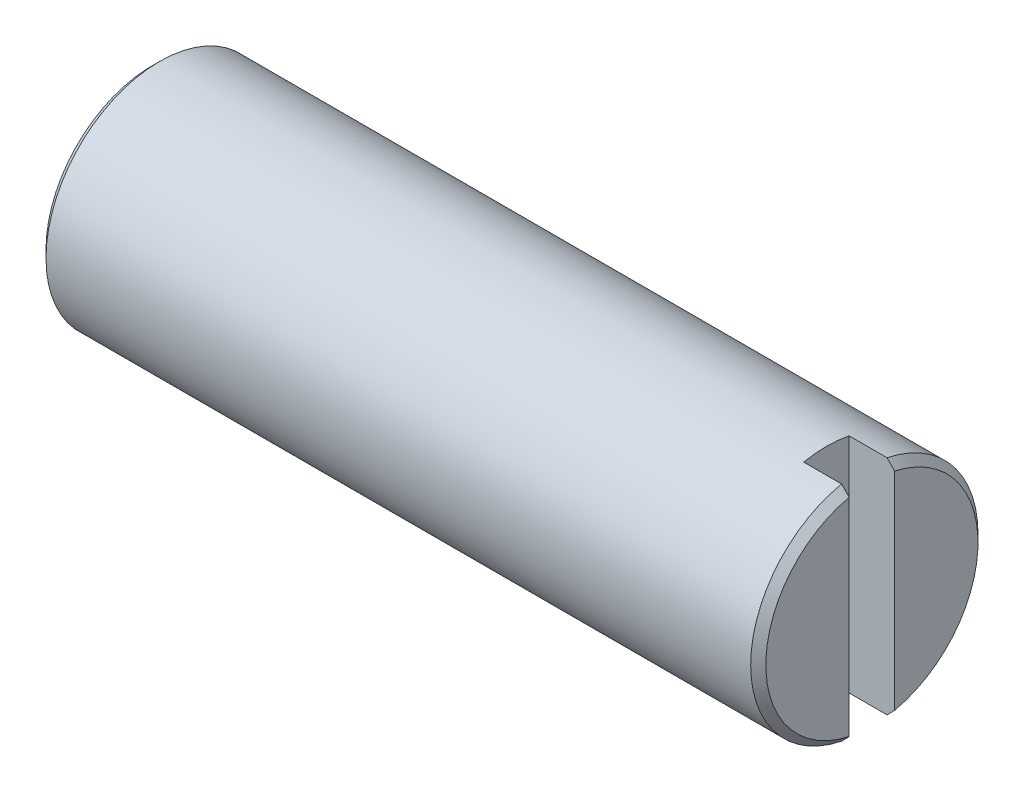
ISO-10303-21;
HEADER;
FILE_DESCRIPTION(('STEP AP214'),'2;1');
FILE_NAME('part.step','',(''),(''),'','','');
FILE_SCHEMA(('AUTOMOTIVE_DESIGN { 1 0 10303 214 1 1 1 1 }'));
ENDSEC;
DATA;
#1=APPLICATION_CONTEXT('core data for automotive mechanical design processes');
#2=APPLICATION_PROTOCOL_DEFINITION('international standard','automotive_design',2000,#1);
#3=PRODUCT_CONTEXT('',#1,'mechanical');
#4=PRODUCT('Part','Part','',(#3));
#5=PRODUCT_RELATED_PRODUCT_CATEGORY('part','',(#4));
#6=PRODUCT_DEFINITION_FORMATION('','',#4);
#7=PRODUCT_DEFINITION_CONTEXT('part definition',#1,'design');
#8=PRODUCT_DEFINITION('design','',#6,#7);
#9=PRODUCT_DEFINITION_SHAPE('','',#8);
#10=(LENGTH_UNIT() NAMED_UNIT(*) SI_UNIT(.MILLI.,.METRE.));
#11=(NAMED_UNIT(*) PLANE_ANGLE_UNIT() SI_UNIT($,.RADIAN.));
#12=(NAMED_UNIT(*) SI_UNIT($,.STERADIAN.) SOLID_ANGLE_UNIT());
#13=UNCERTAINTY_MEASURE_WITH_UNIT(LENGTH_MEASURE(1.E-05),#10,'distance_accuracy_value','');
#14=(GEOMETRIC_REPRESENTATION_CONTEXT(3) GLOBAL_UNCERTAINTY_ASSIGNED_CONTEXT((#13)) GLOBAL_UNIT_ASSIGNED_CONTEXT((#10,
#11,#12)) REPRESENTATION_CONTEXT('',''));
#15=CARTESIAN_POINT('',(0.,0.,0.));
#16=DIRECTION('',(0.,0.,1.));
#17=DIRECTION('',(1.,0.,0.));
#18=AXIS2_PLACEMENT_3D('',#15,#16,#17);
#19=CARTESIAN_POINT('',(0.,-13.674794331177,-65.3333333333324));
#20=DIRECTION('',(1.,0.,0.));
#21=DIRECTION('',(0.,1.,0.));
#22=AXIS2_PLACEMENT_3D('',#19,#20,#21);
#23=PLANE('',#22);
#24=CARTESIAN_POINT('',(0.,0.,0.));
#25=DIRECTION('',(-1.,0.,0.));
#26=DIRECTION('',(0.,0.,1.));
#27=AXIS2_PLACEMENT_3D('',#24,#25,#26);
#28=CIRCLE('',#27,14.);
#29=CARTESIAN_POINT('',(0.,-13.6747943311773,-3.));
#30=VERTEX_POINT('',#29);
#31=CARTESIAN_POINT('',(0.,13.6747943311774,-3.));
#32=VERTEX_POINT('',#31);
#33=EDGE_CURVE('E19',#30,#32,#28,.F.);
#34=ORIENTED_EDGE('',*,*,#33,.T.);
#35=DIRECTION('',(0.,-1.,0.));
#36=VECTOR('',#35,1.);
#37=CARTESIAN_POINT('',(0.,0.,-3.));
#38=LINE('',#37,#36);
#39=EDGE_CURVE('E72',#32,#30,#38,.T.);
#40=ORIENTED_EDGE('',*,*,#39,.T.);
#41=EDGE_LOOP('',(#34,#40));
#42=FACE_BOUND('',#41,.T.);
#43=ADVANCED_FACE('F15',(#42),#23,.T.);
#44=CARTESIAN_POINT('',(-95.,14.,-14.));
#45=DIRECTION('',(-1.,0.,0.));
#46=DIRECTION('',(0.,-1.,0.));
#47=AXIS2_PLACEMENT_3D('',#44,#45,#46);
#48=PLANE('',#47);
#49=CARTESIAN_POINT('',(-95.,0.,0.));
#50=DIRECTION('',(1.,0.,0.));
#51=DIRECTION('',(0.,0.,-1.));
#52=AXIS2_PLACEMENT_3D('',#49,#50,#51);
#53=CIRCLE('',#52,14.);
#54=CARTESIAN_POINT('',(-95.,0.,-14.));
#55=VERTEX_POINT('',#54);
#56=EDGE_CURVE('E82',#55,#55,#53,.F.);
#57=ORIENTED_EDGE('',*,*,#56,.T.);
#58=EDGE_LOOP('',(#57));
#59=FACE_BOUND('',#58,.T.);
#60=ADVANCED_FACE('F123',(#59),#48,.T.);
#61=CARTESIAN_POINT('',(-1.,0.,0.));
#62=DIRECTION('',(-1.,0.,0.));
#63=DIRECTION('',(0.,0.,1.));
#64=AXIS2_PLACEMENT_3D('',#61,#62,#63);
#65=CONICAL_SURFACE('',#64,15.,0.785398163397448);
#66=CARTESIAN_POINT('',(-1.,0.,0.));
#67=DIRECTION('',(1.,0.,0.));
#68=DIRECTION('',(0.,1.,0.));
#69=AXIS2_PLACEMENT_3D('',#66,#67,#68);
#70=CIRCLE('',#69,15.);
#71=CARTESIAN_POINT('',(-1.,-14.6969384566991,-2.99999999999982));
#72=VERTEX_POINT('',#71);
#73=CARTESIAN_POINT('',(-1.,14.6969384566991,-2.99999999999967));
#74=VERTEX_POINT('',#73);
#75=EDGE_CURVE('E78',#72,#74,#70,.T.);
#76=ORIENTED_EDGE('',*,*,#75,.T.);
#77=CARTESIAN_POINT('',(-1.00000000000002,14.6969384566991,-3.));
#78=CARTESIAN_POINT('',(-0.910685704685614,14.6057823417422,-3.00000000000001));
#79=CARTESIAN_POINT('',(-0.82138828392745,14.5146096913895,-3.));
#80=CARTESIAN_POINT('',(-0.645449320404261,14.3349053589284,-2.99999999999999));
#81=CARTESIAN_POINT('',(-0.558806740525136,14.2463746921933,-2.99999999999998));
#82=CARTESIAN_POINT('',(-0.314727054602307,13.9968754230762,-2.99999999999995));
#83=CARTESIAN_POINT('',(-0.157331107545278,13.8358665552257,-2.99999999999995));
#84=CARTESIAN_POINT('',(0.,13.6747943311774,-3.));
#85=B_SPLINE_CURVE_WITH_KNOTS('',3,(#77,#78,#79,#80,#81,#82,#83,#84),.UNSPECIFIED.,.F.,.F.,(4,2,
2,4),(0.,0.382855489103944,0.754475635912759,1.42995767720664),.UNSPECIFIED.);
#86=EDGE_CURVE('E75',#74,#32,#85,.T.);
#87=ORIENTED_EDGE('',*,*,#86,.T.);
#88=ORIENTED_EDGE('',*,*,#33,.F.);
#89=CARTESIAN_POINT('',(0.,-13.6747943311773,-3.));
#90=CARTESIAN_POINT('',(-0.105754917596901,-13.7830640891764,-2.99999999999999));
#91=CARTESIAN_POINT('',(-0.211539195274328,-13.8913051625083,-2.99999999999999));
#92=CARTESIAN_POINT('',(-0.403944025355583,-14.0880782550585,-2.99999999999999));
#93=CARTESIAN_POINT('',(-0.490555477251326,-14.1766191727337,-2.99999999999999));
#94=CARTESIAN_POINT('',(-0.718078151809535,-14.4091186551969,-3.));
#95=CARTESIAN_POINT('',(-0.859018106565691,-14.5530491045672,-3.));
#96=CARTESIAN_POINT('',(-1.00000000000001,-14.6969384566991,-3.));
#97=B_SPLINE_CURVE_WITH_KNOTS('',3,(#89,#90,#91,#92,#93,#94,#95,#96),.UNSPECIFIED.,.F.,.F.,(4,2,
2,4),(0.,0.454046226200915,0.82562304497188,1.4299576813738),.UNSPECIFIED.);
#98=EDGE_CURVE('E66',#30,#72,#97,.T.);
#99=ORIENTED_EDGE('',*,*,#98,.T.);
#100=EDGE_LOOP('',(#76,#87,#88,#99));
#101=FACE_BOUND('',#100,.T.);
#102=ADVANCED_FACE('F76',(#101),#65,.T.);
#103=CARTESIAN_POINT('',(0.,-14.696938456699,-3.));
#104=DIRECTION('',(0.,0.,-1.));
#105=DIRECTION('',(-1.,0.,0.));
#106=AXIS2_PLACEMENT_3D('',#103,#104,#105);
#107=PLANE('',#106);
#108=ORIENTED_EDGE('',*,*,#86,.F.);
#109=DIRECTION('',(-1.,0.,0.));
#110=VECTOR('',#109,1.);
#111=CARTESIAN_POINT('',(-47.5,14.6969384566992,-2.99999999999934));
#112=LINE('',#111,#110);
#113=CARTESIAN_POINT('',(-6.00000000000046,14.6969384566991,-2.99999999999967));
#114=VERTEX_POINT('',#113);
#115=EDGE_CURVE('E165',#74,#114,#112,.T.);
#116=ORIENTED_EDGE('',*,*,#115,.T.);
#117=DIRECTION('',(0.,-1.,0.));
#118=VECTOR('',#117,1.);
#119=CARTESIAN_POINT('',(-6.,-0.154655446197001,-3.));
#120=LINE('',#119,#118);
#121=CARTESIAN_POINT('',(-6.00000000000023,-14.6969384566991,-2.99999999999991));
#122=VERTEX_POINT('',#121);
#123=EDGE_CURVE('E85',#114,#122,#120,.T.);
#124=ORIENTED_EDGE('',*,*,#123,.T.);
#125=DIRECTION('',(1.,0.,0.));
#126=VECTOR('',#125,1.);
#127=CARTESIAN_POINT('',(-47.5,-14.6969384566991,-2.99999999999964));
#128=LINE('',#127,#126);
#129=EDGE_CURVE('E89',#122,#72,#128,.T.);
#130=ORIENTED_EDGE('',*,*,#129,.T.);
#131=ORIENTED_EDGE('',*,*,#98,.F.);
#132=ORIENTED_EDGE('',*,*,#39,.F.);
#133=EDGE_LOOP('',(#108,#116,#124,#130,#131,#132));
#134=FACE_BOUND('',#133,.T.);
#135=ADVANCED_FACE('F81',(#134),#107,.F.);
#136=CARTESIAN_POINT('',(-95.,0.,0.));
#137=DIRECTION('',(1.,0.,0.));
#138=DIRECTION('',(0.,0.,-1.));
#139=AXIS2_PLACEMENT_3D('',#136,#137,#138);
#140=CONICAL_SURFACE('',#139,14.,0.785398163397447);
#141=ORIENTED_EDGE('',*,*,#56,.F.);
#142=EDGE_LOOP('',(#141));
#143=FACE_BOUND('',#142,.T.);
#144=CARTESIAN_POINT('',(-94.,0.,0.));
#145=DIRECTION('',(1.,0.,0.));
#146=DIRECTION('',(0.,1.,0.));
#147=AXIS2_PLACEMENT_3D('',#144,#145,#146);
#148=CIRCLE('',#147,15.);
#149=CARTESIAN_POINT('',(-94.,15.,0.));
#150=VERTEX_POINT('',#149);
#151=EDGE_CURVE('E174',#150,#150,#148,.F.);
#152=ORIENTED_EDGE('',*,*,#151,.T.);
#153=EDGE_LOOP('',(#152));
#154=FACE_BOUND('',#153,.T.);
#155=ADVANCED_FACE('F118',(#143,#154),#140,.T.);
#156=CARTESIAN_POINT('',(-6.,15.,-3.));
#157=DIRECTION('',(-1.,0.,0.));
#158=DIRECTION('',(0.,-1.,0.));
#159=AXIS2_PLACEMENT_3D('',#156,#157,#158);
#160=PLANE('',#159);
#161=CARTESIAN_POINT('',(-6.00000000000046,0.,0.));
#162=DIRECTION('',(1.,0.,0.));
#163=DIRECTION('',(0.,0.,-1.));
#164=AXIS2_PLACEMENT_3D('',#161,#162,#163);
#165=CIRCLE('',#164,15.);
#166=CARTESIAN_POINT('',(-6.0000000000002,14.696938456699,3.));
#167=VERTEX_POINT('',#166);
#168=EDGE_CURVE('E166',#114,#167,#165,.T.);
#169=ORIENTED_EDGE('',*,*,#168,.T.);
#170=DIRECTION('',(0.,-1.,0.));
#171=VECTOR('',#170,1.);
#172=CARTESIAN_POINT('',(-5.99999999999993,0.,3.));
#173=LINE('',#172,#171);
#174=CARTESIAN_POINT('',(-6.0000000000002,-14.696938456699,3.));
#175=VERTEX_POINT('',#174);
#176=EDGE_CURVE('E159',#167,#175,#173,.T.);
#177=ORIENTED_EDGE('',*,*,#176,.T.);
#178=CARTESIAN_POINT('',(-6.00000000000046,0.,0.));
#179=DIRECTION('',(1.,0.,0.));
#180=DIRECTION('',(0.,0.,-1.));
#181=AXIS2_PLACEMENT_3D('',#178,#179,#180);
#182=CIRCLE('',#181,15.);
#183=EDGE_CURVE('E167',#175,#122,#182,.T.);
#184=ORIENTED_EDGE('',*,*,#183,.T.);
#185=ORIENTED_EDGE('',*,*,#123,.F.);
#186=EDGE_LOOP('',(#169,#177,#184,#185));
#187=FACE_BOUND('',#186,.T.);
#188=ADVANCED_FACE('F113',(#187),#160,.F.);
#189=CARTESIAN_POINT('',(-94.,0.,0.));
#190=DIRECTION('',(1.,0.,0.));
#191=DIRECTION('',(0.,0.,-1.));
#192=AXIS2_PLACEMENT_3D('',#189,#190,#191);
#193=CYLINDRICAL_SURFACE('',#192,15.);
#194=ORIENTED_EDGE('',*,*,#151,.F.);
#195=EDGE_LOOP('',(#194));
#196=FACE_BOUND('',#195,.T.);
#197=DIRECTION('',(-1.,0.,0.));
#198=VECTOR('',#197,1.);
#199=CARTESIAN_POINT('',(-14.696938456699,14.696938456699,3.));
#200=LINE('',#199,#198);
#201=CARTESIAN_POINT('',(-1.,14.696938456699,3.));
#202=VERTEX_POINT('',#201);
#203=EDGE_CURVE('E155',#202,#167,#200,.T.);
#204=ORIENTED_EDGE('',*,*,#203,.T.);
#205=ORIENTED_EDGE('',*,*,#168,.F.);
#206=ORIENTED_EDGE('',*,*,#115,.F.);
#207=ORIENTED_EDGE('',*,*,#75,.F.);
#208=ORIENTED_EDGE('',*,*,#129,.F.);
#209=ORIENTED_EDGE('',*,*,#183,.F.);
#210=DIRECTION('',(1.,0.,0.));
#211=VECTOR('',#210,1.);
#212=CARTESIAN_POINT('',(-14.696938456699,-14.696938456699,3.));
#213=LINE('',#212,#211);
#214=CARTESIAN_POINT('',(-0.999999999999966,-14.696938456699,3.));
#215=VERTEX_POINT('',#214);
#216=EDGE_CURVE('E98',#175,#215,#213,.T.);
#217=ORIENTED_EDGE('',*,*,#216,.T.);
#218=CARTESIAN_POINT('',(-1.,0.,0.));
#219=DIRECTION('',(1.,0.,0.));
#220=DIRECTION('',(0.,1.,0.));
#221=AXIS2_PLACEMENT_3D('',#218,#219,#220);
#222=CIRCLE('',#221,15.);
#223=EDGE_CURVE('E154',#215,#202,#222,.F.);
#224=ORIENTED_EDGE('',*,*,#223,.T.);
#225=EDGE_LOOP('',(#204,#205,#206,#207,#208,#209,#217,#224));
#226=FACE_BOUND('',#225,.T.);
#227=ADVANCED_FACE('F117',(#196,#226),#193,.T.);
#228=CARTESIAN_POINT('',(-1.,0.,0.));
#229=DIRECTION('',(-1.,0.,0.));
#230=DIRECTION('',(0.,0.,1.));
#231=AXIS2_PLACEMENT_3D('',#228,#229,#230);
#232=CONICAL_SURFACE('',#231,15.,0.785398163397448);
#233=ORIENTED_EDGE('',*,*,#223,.F.);
#234=CARTESIAN_POINT('',(-0.999999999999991,-14.6969384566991,3.));
#235=CARTESIAN_POINT('',(-0.910685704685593,-14.6057823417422,3.00000000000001));
#236=CARTESIAN_POINT('',(-0.821388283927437,-14.5146096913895,3.00000000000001));
#237=CARTESIAN_POINT('',(-0.645449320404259,-14.3349053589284,2.99999999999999));
#238=CARTESIAN_POINT('',(-0.558806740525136,-14.2463746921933,2.99999999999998));
#239=CARTESIAN_POINT('',(-0.314727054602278,-13.9968754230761,2.99999999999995));
#240=CARTESIAN_POINT('',(-0.157331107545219,-13.8358665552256,2.99999999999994));
#241=CARTESIAN_POINT('',(0.,-13.6747943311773,3.));
#242=B_SPLINE_CURVE_WITH_KNOTS('',3,(#234,#235,#236,#237,#238,#239,#240,#241),.UNSPECIFIED.,.F.,
.F.,(4,2,2,4),(0.,0.382855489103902,0.754475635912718,1.42995767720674),.UNSPECIFIED.);
#243=CARTESIAN_POINT('',(0.,-13.6747943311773,3.00000000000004));
#244=VERTEX_POINT('',#243);
#245=EDGE_CURVE('E34',#215,#244,#242,.T.);
#246=ORIENTED_EDGE('',*,*,#245,.T.);
#247=CARTESIAN_POINT('',(0.,0.,0.));
#248=DIRECTION('',(-1.,0.,0.));
#249=DIRECTION('',(0.,0.,1.));
#250=AXIS2_PLACEMENT_3D('',#247,#248,#249);
#251=CIRCLE('',#250,14.);
#252=CARTESIAN_POINT('',(0.,13.6747943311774,3.00000000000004));
#253=VERTEX_POINT('',#252);
#254=EDGE_CURVE('E25',#253,#244,#251,.F.);
#255=ORIENTED_EDGE('',*,*,#254,.F.);
#256=CARTESIAN_POINT('',(0.,13.6747943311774,3.));
#257=CARTESIAN_POINT('',(-0.105754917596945,13.7830640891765,3.));
#258=CARTESIAN_POINT('',(-0.21153919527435,13.8913051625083,2.99999999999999));
#259=CARTESIAN_POINT('',(-0.403944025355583,14.0880782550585,2.99999999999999));
#260=CARTESIAN_POINT('',(-0.490555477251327,14.1766191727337,2.99999999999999));
#261=CARTESIAN_POINT('',(-0.718078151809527,14.4091186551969,2.99999999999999));
#262=CARTESIAN_POINT('',(-0.859018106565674,14.5530491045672,3.));
#263=CARTESIAN_POINT('',(-0.999999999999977,14.696938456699,3.));
#264=B_SPLINE_CURVE_WITH_KNOTS('',3,(#256,#257,#258,#259,#260,#261,#262,#263),.UNSPECIFIED.,.F.,
.F.,(4,2,2,4),(0.,0.454046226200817,0.825623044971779,1.42995768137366),.UNSPECIFIED.);
#265=EDGE_CURVE('E99',#253,#202,#264,.T.);
#266=ORIENTED_EDGE('',*,*,#265,.T.);
#267=EDGE_LOOP('',(#233,#246,#255,#266));
#268=FACE_BOUND('',#267,.T.);
#269=ADVANCED_FACE('F104',(#268),#232,.T.);
#270=CARTESIAN_POINT('',(0.,14.696938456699,3.));
#271=DIRECTION('',(0.,0.,1.));
#272=DIRECTION('',(-1.,0.,0.));
#273=AXIS2_PLACEMENT_3D('',#270,#271,#272);
#274=PLANE('',#273);
#275=ORIENTED_EDGE('',*,*,#245,.F.);
#276=ORIENTED_EDGE('',*,*,#216,.F.);
#277=ORIENTED_EDGE('',*,*,#176,.F.);
#278=ORIENTED_EDGE('',*,*,#203,.F.);
#279=ORIENTED_EDGE('',*,*,#265,.F.);
#280=DIRECTION('',(0.,1.,0.));
#281=VECTOR('',#280,1.);
#282=CARTESIAN_POINT('',(0.,0.325205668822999,3.00000000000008));
#283=LINE('',#282,#281);
#284=EDGE_CURVE('E10',#244,#253,#283,.T.);
#285=ORIENTED_EDGE('',*,*,#284,.F.);
#286=EDGE_LOOP('',(#275,#276,#277,#278,#279,#285));
#287=FACE_BOUND('',#286,.T.);
#288=ADVANCED_FACE('F108',(#287),#274,.F.);
#289=CARTESIAN_POINT('',(0.,-13.674794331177,-14.));
#290=DIRECTION('',(1.,0.,0.));
#291=DIRECTION('',(0.,1.,0.));
#292=AXIS2_PLACEMENT_3D('',#289,#290,#291);
#293=PLANE('',#292);
#294=ORIENTED_EDGE('',*,*,#254,.T.);
#295=ORIENTED_EDGE('',*,*,#284,.T.);
#296=EDGE_LOOP('',(#294,#295));
#297=FACE_BOUND('',#296,.T.);
#298=ADVANCED_FACE('F17',(#297),#293,.T.);
#299=CLOSED_SHELL('',(#43,#60,#102,#135,#155,#188,#227,#269,#288,#298));
#300=MANIFOLD_SOLID_BREP('B1',#299);
#301=ADVANCED_BREP_SHAPE_REPRESENTATION('',(#18,#300),#14);
#302=SHAPE_DEFINITION_REPRESENTATION(#9,#301);
ENDSEC;
END-ISO-10303-21;
